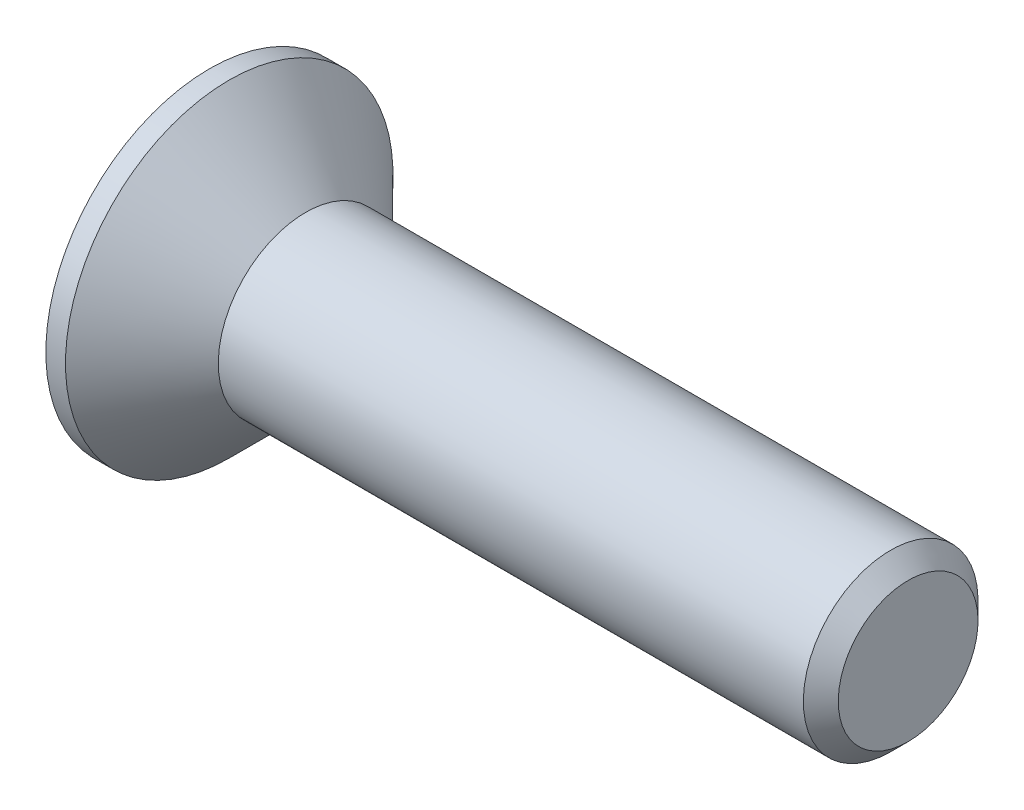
from build123d import *

# Parameters (mm, degrees)
CHAMFER1_SIZE      = 0.4
CUT_EXTRUDE1_DEPTH = 1.9


with BuildPart() as part:
    # Sketch1 → Revolve1 (revolve)
    with BuildSketch(Plane.XY, mode=Mode.PRIVATE) as revolve1_sk:
        Polygon((-2.2, 3.75), (-2.2, 0), (13.8, 0), (13.8, 2), (0, 2), (-1.75, 3.75), align=None)
    revolve(revolve1_sk.sketch.rotate(Axis((-2.2, 0, 0), (1, 0, 0)), 180), axis=Axis((-2.2, 0, 0), (1, 0, 0)))

    # Chamfer1
    chamfer1_edges = [part.edges().sort_by_distance(p)[0] for p in [
        (13.8, 2, 0),
    ]]
    chamfer(chamfer1_edges, length=CHAMFER1_SIZE)

    # Sketch2 → Cut-Extrude1 (cut)
    with BuildSketch(Plane.ZY.offset(2.2)):
        Polygon((-0.55, 2.2), (0.55, 2.2), (0.55, 0.55), (2.2, 0.55), (2.2, -0.55), (0.55, -0.55), (0.55, -2.2), (-0.55, -2.2), (-0.55, -0.55), (-2.2, -0.55), (-2.2, 0.55), (-0.55, 0.55), align=None)
    extrude(amount=-CUT_EXTRUDE1_DEPTH, mode=Mode.SUBTRACT)


solid = part.part
